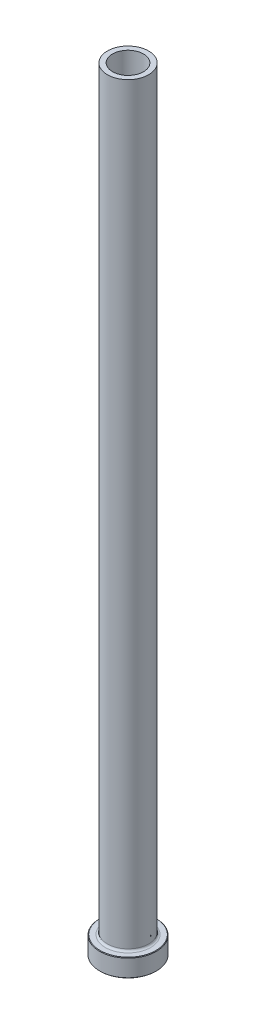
ISO-10303-21;
HEADER;
FILE_DESCRIPTION(('STEP AP214'),'2;1');
FILE_NAME('part.step','',(''),(''),'','','');
FILE_SCHEMA(('AUTOMOTIVE_DESIGN { 1 0 10303 214 1 1 1 1 }'));
ENDSEC;
DATA;
#1=APPLICATION_CONTEXT('core data for automotive mechanical design processes');
#2=APPLICATION_PROTOCOL_DEFINITION('international standard','automotive_design',2000,#1);
#3=PRODUCT_CONTEXT('',#1,'mechanical');
#4=PRODUCT('Part','Part','',(#3));
#5=PRODUCT_RELATED_PRODUCT_CATEGORY('part','',(#4));
#6=PRODUCT_DEFINITION_FORMATION('','',#4);
#7=PRODUCT_DEFINITION_CONTEXT('part definition',#1,'design');
#8=PRODUCT_DEFINITION('design','',#6,#7);
#9=PRODUCT_DEFINITION_SHAPE('','',#8);
#10=(LENGTH_UNIT() NAMED_UNIT(*) SI_UNIT(.MILLI.,.METRE.));
#11=(NAMED_UNIT(*) PLANE_ANGLE_UNIT() SI_UNIT($,.RADIAN.));
#12=(NAMED_UNIT(*) SI_UNIT($,.STERADIAN.) SOLID_ANGLE_UNIT());
#13=UNCERTAINTY_MEASURE_WITH_UNIT(LENGTH_MEASURE(1.E-05),#10,'distance_accuracy_value','');
#14=(GEOMETRIC_REPRESENTATION_CONTEXT(3) GLOBAL_UNCERTAINTY_ASSIGNED_CONTEXT((#13)) GLOBAL_UNIT_ASSIGNED_CONTEXT((#10,
#11,#12)) REPRESENTATION_CONTEXT('',''));
#15=CARTESIAN_POINT('',(0.,0.,0.));
#16=DIRECTION('',(0.,0.,1.));
#17=DIRECTION('',(1.,0.,0.));
#18=AXIS2_PLACEMENT_3D('',#15,#16,#17);
#19=CARTESIAN_POINT('',(0.,92.1876809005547,0.));
#20=DIRECTION('',(0.,1.,0.));
#21=DIRECTION('',(0.,0.,1.));
#22=AXIS2_PLACEMENT_3D('',#19,#20,#21);
#23=CYLINDRICAL_SURFACE('',#22,6.00000000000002);
#24=CARTESIAN_POINT('',(0.,300.,0.));
#25=DIRECTION('',(0.,1.,0.));
#26=DIRECTION('',(0.,0.,1.));
#27=AXIS2_PLACEMENT_3D('',#24,#25,#26);
#28=CIRCLE('',#27,6.00000000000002);
#29=CARTESIAN_POINT('',(0.,300.,6.00000000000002));
#30=VERTEX_POINT('',#29);
#31=EDGE_CURVE('E62',#30,#30,#28,.T.);
#32=ORIENTED_EDGE('',*,*,#31,.T.);
#33=EDGE_LOOP('',(#32));
#34=FACE_BOUND('',#33,.T.);
#35=CARTESIAN_POINT('',(0.,245.,0.));
#36=DIRECTION('',(0.,1.,0.));
#37=DIRECTION('',(0.,0.,1.));
#38=AXIS2_PLACEMENT_3D('',#35,#36,#37);
#39=CIRCLE('',#38,6.00000000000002);
#40=CARTESIAN_POINT('',(0.,245.,6.00000000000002));
#41=VERTEX_POINT('',#40);
#42=EDGE_CURVE('E71',#41,#41,#39,.T.);
#43=ORIENTED_EDGE('',*,*,#42,.F.);
#44=EDGE_LOOP('',(#43));
#45=FACE_BOUND('',#44,.T.);
#46=ADVANCED_FACE('F30',(#34,#45),#23,.F.);
#47=CARTESIAN_POINT('',(-6.00000000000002,300.,0.));
#48=DIRECTION('',(0.,1.,0.));
#49=DIRECTION('',(0.,0.,1.));
#50=AXIS2_PLACEMENT_3D('',#47,#48,#49);
#51=PLANE('',#50);
#52=CARTESIAN_POINT('',(0.,300.,0.));
#53=DIRECTION('',(0.,1.,0.));
#54=DIRECTION('',(0.,0.,1.));
#55=AXIS2_PLACEMENT_3D('',#52,#53,#54);
#56=CIRCLE('',#55,8.00000000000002);
#57=CARTESIAN_POINT('',(0.,300.,8.00000000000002));
#58=VERTEX_POINT('',#57);
#59=EDGE_CURVE('E65',#58,#58,#56,.T.);
#60=ORIENTED_EDGE('',*,*,#59,.T.);
#61=EDGE_LOOP('',(#60));
#62=FACE_BOUND('',#61,.T.);
#63=ORIENTED_EDGE('',*,*,#31,.F.);
#64=EDGE_LOOP('',(#63));
#65=FACE_BOUND('',#64,.T.);
#66=ADVANCED_FACE('F79',(#62,#65),#51,.T.);
#67=CARTESIAN_POINT('',(0.,92.1876809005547,0.));
#68=DIRECTION('',(0.,1.,0.));
#69=DIRECTION('',(0.,0.,1.));
#70=AXIS2_PLACEMENT_3D('',#67,#68,#69);
#71=CYLINDRICAL_SURFACE('',#70,8.00000000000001);
#72=CARTESIAN_POINT('',(0.,7.8,0.));
#73=DIRECTION('',(0.,1.,0.));
#74=DIRECTION('',(0.,0.,1.));
#75=AXIS2_PLACEMENT_3D('',#72,#73,#74);
#76=CIRCLE('',#75,8.00000000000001);
#77=CARTESIAN_POINT('',(0.,7.8,8.00000000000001));
#78=VERTEX_POINT('',#77);
#79=EDGE_CURVE('E59',#78,#78,#76,.T.);
#80=ORIENTED_EDGE('',*,*,#79,.T.);
#81=EDGE_LOOP('',(#80));
#82=FACE_BOUND('',#81,.T.);
#83=ORIENTED_EDGE('',*,*,#59,.F.);
#84=EDGE_LOOP('',(#83));
#85=FACE_BOUND('',#84,.T.);
#86=ADVANCED_FACE('F85',(#82,#85),#71,.T.);
#87=CARTESIAN_POINT('',(-7.99999999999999,7.,0.));
#88=DIRECTION('',(0.,1.,0.));
#89=DIRECTION('',(0.,0.,1.));
#90=AXIS2_PLACEMENT_3D('',#87,#88,#89);
#91=PLANE('',#90);
#92=CARTESIAN_POINT('',(0.,7.,0.));
#93=DIRECTION('',(0.,1.,0.));
#94=DIRECTION('',(0.,0.,1.));
#95=AXIS2_PLACEMENT_3D('',#92,#93,#94);
#96=CIRCLE('',#95,10.8);
#97=CARTESIAN_POINT('',(0.,7.,-10.8));
#98=VERTEX_POINT('',#97);
#99=EDGE_CURVE('E53',#98,#98,#96,.T.);
#100=ORIENTED_EDGE('',*,*,#99,.T.);
#101=EDGE_LOOP('',(#100));
#102=FACE_BOUND('',#101,.T.);
#103=CARTESIAN_POINT('',(0.,7.,0.));
#104=DIRECTION('',(0.,1.,0.));
#105=DIRECTION('',(0.,0.,1.));
#106=AXIS2_PLACEMENT_3D('',#103,#104,#105);
#107=CIRCLE('',#106,8.80000000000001);
#108=CARTESIAN_POINT('',(0.,7.,8.80000000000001));
#109=VERTEX_POINT('',#108);
#110=EDGE_CURVE('E56',#109,#109,#107,.F.);
#111=ORIENTED_EDGE('',*,*,#110,.T.);
#112=EDGE_LOOP('',(#111));
#113=FACE_BOUND('',#112,.T.);
#114=ADVANCED_FACE('F111',(#102,#113),#91,.T.);
#115=CARTESIAN_POINT('',(0.,92.1876809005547,0.));
#116=DIRECTION('',(0.,1.,0.));
#117=DIRECTION('',(0.,0.,1.));
#118=AXIS2_PLACEMENT_3D('',#115,#116,#117);
#119=CYLINDRICAL_SURFACE('',#118,11.);
#120=CARTESIAN_POINT('',(0.,6.80000000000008,0.));
#121=DIRECTION('',(0.,1.,0.));
#122=DIRECTION('',(0.,0.,1.));
#123=AXIS2_PLACEMENT_3D('',#120,#121,#122);
#124=CIRCLE('',#123,11.);
#125=CARTESIAN_POINT('',(0.,6.80000000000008,-11.));
#126=VERTEX_POINT('',#125);
#127=EDGE_CURVE('E45',#126,#126,#124,.F.);
#128=ORIENTED_EDGE('',*,*,#127,.T.);
#129=EDGE_LOOP('',(#128));
#130=FACE_BOUND('',#129,.T.);
#131=CARTESIAN_POINT('',(0.,0.200000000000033,0.));
#132=DIRECTION('',(0.,-1.,0.));
#133=DIRECTION('',(0.,0.,-1.));
#134=AXIS2_PLACEMENT_3D('',#131,#132,#133);
#135=CIRCLE('',#134,11.);
#136=CARTESIAN_POINT('',(0.,0.200000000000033,-11.));
#137=VERTEX_POINT('',#136);
#138=EDGE_CURVE('E50',#137,#137,#135,.F.);
#139=ORIENTED_EDGE('',*,*,#138,.T.);
#140=EDGE_LOOP('',(#139));
#141=FACE_BOUND('',#140,.T.);
#142=ADVANCED_FACE('F108',(#130,#141),#119,.T.);
#143=CARTESIAN_POINT('',(-11.,0.,0.));
#144=DIRECTION('',(0.,-1.,0.));
#145=DIRECTION('',(0.,0.,-1.));
#146=AXIS2_PLACEMENT_3D('',#143,#144,#145);
#147=PLANE('',#146);
#148=CARTESIAN_POINT('',(0.,0.,0.));
#149=DIRECTION('',(0.,-1.,0.));
#150=DIRECTION('',(0.,0.,-1.));
#151=AXIS2_PLACEMENT_3D('',#148,#149,#150);
#152=CIRCLE('',#151,6.74999999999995);
#153=CARTESIAN_POINT('',(0.,0.,-6.74999999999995));
#154=VERTEX_POINT('',#153);
#155=EDGE_CURVE('E37',#154,#154,#152,.F.);
#156=ORIENTED_EDGE('',*,*,#155,.T.);
#157=EDGE_LOOP('',(#156));
#158=FACE_BOUND('',#157,.T.);
#159=CARTESIAN_POINT('',(0.,0.,0.));
#160=DIRECTION('',(0.,-1.,0.));
#161=DIRECTION('',(0.,0.,-1.));
#162=AXIS2_PLACEMENT_3D('',#159,#160,#161);
#163=CIRCLE('',#162,10.8);
#164=CARTESIAN_POINT('',(0.,0.,-10.8));
#165=VERTEX_POINT('',#164);
#166=EDGE_CURVE('E41',#165,#165,#163,.T.);
#167=ORIENTED_EDGE('',*,*,#166,.T.);
#168=EDGE_LOOP('',(#167));
#169=FACE_BOUND('',#168,.T.);
#170=ADVANCED_FACE('F110',(#158,#169),#147,.T.);
#171=CARTESIAN_POINT('',(0.,92.1876809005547,0.));
#172=DIRECTION('',(0.,1.,0.));
#173=DIRECTION('',(0.,0.,1.));
#174=AXIS2_PLACEMENT_3D('',#171,#172,#173);
#175=CYLINDRICAL_SURFACE('',#174,6.25);
#176=CARTESIAN_POINT('',(0.,0.499999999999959,0.));
#177=DIRECTION('',(0.,-1.,0.));
#178=DIRECTION('',(0.,0.,-1.));
#179=AXIS2_PLACEMENT_3D('',#176,#177,#178);
#180=CIRCLE('',#179,6.25);
#181=CARTESIAN_POINT('',(0.,0.499999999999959,-6.25));
#182=VERTEX_POINT('',#181);
#183=EDGE_CURVE('E10',#182,#182,#180,.T.);
#184=ORIENTED_EDGE('',*,*,#183,.T.);
#185=EDGE_LOOP('',(#184));
#186=FACE_BOUND('',#185,.T.);
#187=CARTESIAN_POINT('',(0.,233.,0.));
#188=DIRECTION('',(0.,1.,0.));
#189=DIRECTION('',(0.,0.,1.));
#190=AXIS2_PLACEMENT_3D('',#187,#188,#189);
#191=CIRCLE('',#190,6.25000000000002);
#192=CARTESIAN_POINT('',(0.,233.,6.25000000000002));
#193=VERTEX_POINT('',#192);
#194=EDGE_CURVE('E68',#193,#193,#191,.T.);
#195=ORIENTED_EDGE('',*,*,#194,.T.);
#196=EDGE_LOOP('',(#195));
#197=FACE_BOUND('',#196,.T.);
#198=ADVANCED_FACE('F118',(#186,#197),#175,.F.);
#199=CARTESIAN_POINT('',(0.,233.,0.));
#200=DIRECTION('',(0.,-1.,0.));
#201=DIRECTION('',(0.,0.,-1.));
#202=AXIS2_PLACEMENT_3D('',#199,#200,#201);
#203=CONICAL_SURFACE('',#202,6.25000000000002,0.0208303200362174);
#204=ORIENTED_EDGE('',*,*,#42,.T.);
#205=EDGE_LOOP('',(#204));
#206=FACE_BOUND('',#205,.T.);
#207=ORIENTED_EDGE('',*,*,#194,.F.);
#208=EDGE_LOOP('',(#207));
#209=FACE_BOUND('',#208,.T.);
#210=ADVANCED_FACE('F75',(#206,#209),#203,.F.);
#211=CARTESIAN_POINT('',(0.,7.8,0.));
#212=DIRECTION('',(0.,1.,0.));
#213=DIRECTION('',(0.,0.,1.));
#214=AXIS2_PLACEMENT_3D('',#211,#212,#213);
#215=TOROIDAL_SURFACE('',#214,8.80000000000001,0.8);
#216=ORIENTED_EDGE('',*,*,#110,.F.);
#217=EDGE_LOOP('',(#216));
#218=FACE_BOUND('',#217,.T.);
#219=ORIENTED_EDGE('',*,*,#79,.F.);
#220=EDGE_LOOP('',(#219));
#221=FACE_BOUND('',#220,.T.);
#222=ADVANCED_FACE('F90',(#218,#221),#215,.F.);
#223=CARTESIAN_POINT('',(0.,7.00000000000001,0.));
#224=DIRECTION('',(0.,-1.,0.));
#225=DIRECTION('',(0.,0.,-1.));
#226=AXIS2_PLACEMENT_3D('',#223,#224,#225);
#227=CONICAL_SURFACE('',#226,10.8,0.785398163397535);
#228=CARTESIAN_POINT('',(0.,6.80000000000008,-11.));
#229=CARTESIAN_POINT('',(0.,6.80208333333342,-10.9979166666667));
#230=CARTESIAN_POINT('',(0.,6.80416666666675,-10.9958333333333));
#231=CARTESIAN_POINT('',(0.,6.80833333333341,-10.9916666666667));
#232=CARTESIAN_POINT('',(0.,6.81041666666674,-10.9895833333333));
#233=CARTESIAN_POINT('',(0.,6.81458333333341,-10.9854166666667));
#234=CARTESIAN_POINT('',(0.,6.81666666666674,-10.9833333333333));
#235=CARTESIAN_POINT('',(0.,6.82083333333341,-10.9791666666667));
#236=CARTESIAN_POINT('',(0.,6.82291666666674,-10.9770833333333));
#237=CARTESIAN_POINT('',(0.,6.82708333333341,-10.9729166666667));
#238=CARTESIAN_POINT('',(0.,6.82916666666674,-10.9708333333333));
#239=CARTESIAN_POINT('',(0.,6.8333333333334,-10.9666666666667));
#240=CARTESIAN_POINT('',(0.,6.83541666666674,-10.9645833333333));
#241=CARTESIAN_POINT('',(0.,6.8395833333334,-10.9604166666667));
#242=CARTESIAN_POINT('',(0.,6.84166666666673,-10.9583333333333));
#243=CARTESIAN_POINT('',(0.,6.8458333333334,-10.9541666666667));
#244=CARTESIAN_POINT('',(0.,6.84791666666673,-10.9520833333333));
#245=CARTESIAN_POINT('',(0.,6.8520833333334,-10.9479166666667));
#246=CARTESIAN_POINT('',(0.,6.85416666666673,-10.9458333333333));
#247=CARTESIAN_POINT('',(0.,6.85833333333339,-10.9416666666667));
#248=CARTESIAN_POINT('',(0.,6.86041666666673,-10.9395833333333));
#249=CARTESIAN_POINT('',(0.,6.86458333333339,-10.9354166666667));
#250=CARTESIAN_POINT('',(0.,6.86666666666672,-10.9333333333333));
#251=CARTESIAN_POINT('',(0.,6.87083333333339,-10.9291666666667));
#252=CARTESIAN_POINT('',(0.,6.87291666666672,-10.9270833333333));
#253=CARTESIAN_POINT('',(0.,6.87708333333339,-10.9229166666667));
#254=CARTESIAN_POINT('',(0.,6.87916666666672,-10.9208333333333));
#255=CARTESIAN_POINT('',(0.,6.88333333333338,-10.9166666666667));
#256=CARTESIAN_POINT('',(0.,6.88541666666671,-10.9145833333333));
#257=CARTESIAN_POINT('',(0.,6.88958333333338,-10.9104166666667));
#258=CARTESIAN_POINT('',(0.,6.89166666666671,-10.9083333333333));
#259=CARTESIAN_POINT('',(0.,6.89583333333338,-10.9041666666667));
#260=CARTESIAN_POINT('',(0.,6.89791666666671,-10.9020833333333));
#261=CARTESIAN_POINT('',(0.,6.90208333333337,-10.8979166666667));
#262=CARTESIAN_POINT('',(0.,6.90416666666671,-10.8958333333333));
#263=CARTESIAN_POINT('',(0.,6.90833333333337,-10.8916666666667));
#264=CARTESIAN_POINT('',(0.,6.9104166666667,-10.8895833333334));
#265=CARTESIAN_POINT('',(0.,6.91458333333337,-10.8854166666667));
#266=CARTESIAN_POINT('',(0.,6.9166666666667,-10.8833333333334));
#267=CARTESIAN_POINT('',(0.,6.92083333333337,-10.8791666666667));
#268=CARTESIAN_POINT('',(0.,6.9229166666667,-10.8770833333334));
#269=CARTESIAN_POINT('',(0.,6.92708333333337,-10.8729166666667));
#270=CARTESIAN_POINT('',(0.,6.9291666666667,-10.8708333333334));
#271=CARTESIAN_POINT('',(0.,6.93333333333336,-10.8666666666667));
#272=CARTESIAN_POINT('',(0.,6.93541666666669,-10.8645833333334));
#273=CARTESIAN_POINT('',(0.,6.93958333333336,-10.8604166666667));
#274=CARTESIAN_POINT('',(0.,6.94166666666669,-10.8583333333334));
#275=CARTESIAN_POINT('',(0.,6.94583333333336,-10.8541666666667));
#276=CARTESIAN_POINT('',(0.,6.94791666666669,-10.8520833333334));
#277=CARTESIAN_POINT('',(0.,6.95208333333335,-10.8479166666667));
#278=CARTESIAN_POINT('',(0.,6.95416666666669,-10.8458333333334));
#279=CARTESIAN_POINT('',(0.,6.95833333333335,-10.8416666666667));
#280=CARTESIAN_POINT('',(0.,6.96041666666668,-10.8395833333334));
#281=CARTESIAN_POINT('',(0.,6.96458333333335,-10.8354166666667));
#282=CARTESIAN_POINT('',(0.,6.96666666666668,-10.8333333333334));
#283=CARTESIAN_POINT('',(0.,6.97083333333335,-10.8291666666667));
#284=CARTESIAN_POINT('',(0.,6.97291666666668,-10.8270833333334));
#285=CARTESIAN_POINT('',(0.,6.97708333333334,-10.8229166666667));
#286=CARTESIAN_POINT('',(0.,6.97916666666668,-10.8208333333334));
#287=CARTESIAN_POINT('',(0.,6.98333333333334,-10.8166666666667));
#288=CARTESIAN_POINT('',(0.,6.98541666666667,-10.8145833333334));
#289=CARTESIAN_POINT('',(0.,6.98958333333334,-10.8104166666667));
#290=CARTESIAN_POINT('',(0.,6.99166666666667,-10.8083333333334));
#291=CARTESIAN_POINT('',(0.,6.99583333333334,-10.8041666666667));
#292=CARTESIAN_POINT('',(0.,6.99791666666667,-10.8020833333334));
#293=CARTESIAN_POINT('',(0.,7.,-10.8));
#294=B_SPLINE_CURVE_WITH_KNOTS('',3,(#228,#229,#230,#231,#232,#233,#234,#235,#236,#237,#238,
#239,#240,#241,#242,#243,#244,#245,#246,#247,#248,#249,#250,#251,#252,#253,#254,#255,#256,#257,
#258,#259,#260,#261,#262,#263,#264,#265,#266,#267,#268,#269,#270,#271,#272,#273,#274,#275,#276,
#277,#278,#279,#280,#281,#282,#283,#284,#285,#286,#287,#288,#289,#290,#291,#292,#293),
.UNSPECIFIED.,.F.,.F.,(4,2,2,2,2,2,2,2,2,2,2,2,2,2,2,2,2,2,2,2,2,2,2,2,2,2,2,2,2,2,2,2,4),(0.,
0.00883883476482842,0.0176776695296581,0.0265165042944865,0.0353553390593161,0.0441941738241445,
0.0530330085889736,0.061871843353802,0.0707106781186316,0.0795495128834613,0.0883883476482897,
0.0972271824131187,0.106066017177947,0.114904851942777,0.123743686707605,0.132582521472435,
0.141421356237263,0.150260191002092,0.159099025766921,0.16793786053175,0.176776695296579,
0.185615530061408,0.194454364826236,0.203293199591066,0.212132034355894,0.220970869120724,
0.229809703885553,0.238648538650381,0.247487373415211,0.256326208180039,0.265165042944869,
0.274003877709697,0.282842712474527),.UNSPECIFIED.);
#295=EDGE_CURVE('BSEAM93',#126,#98,#294,.T.);
#296=ORIENTED_EDGE('',*,*,#127,.F.);
#297=ORIENTED_EDGE('',*,*,#99,.F.);
#298=ORIENTED_EDGE('',*,*,#295,.T.);
#299=ORIENTED_EDGE('',*,*,#295,.F.);
#300=EDGE_LOOP('',(#296,#298,#297,#299));
#301=FACE_BOUND('',#300,.T.);
#302=ADVANCED_FACE('F93',(#301),#227,.T.);
#303=CARTESIAN_POINT('',(0.,0.200000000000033,0.));
#304=DIRECTION('',(0.,1.,0.));
#305=DIRECTION('',(0.,0.,1.));
#306=AXIS2_PLACEMENT_3D('',#303,#304,#305);
#307=CONICAL_SURFACE('',#306,11.,0.785398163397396);
#308=ORIENTED_EDGE('',*,*,#166,.F.);
#309=EDGE_LOOP('',(#308));
#310=FACE_BOUND('',#309,.T.);
#311=ORIENTED_EDGE('',*,*,#138,.F.);
#312=EDGE_LOOP('',(#311));
#313=FACE_BOUND('',#312,.T.);
#314=ADVANCED_FACE('F96',(#310,#313),#307,.T.);
#315=CARTESIAN_POINT('',(0.,0.,0.));
#316=DIRECTION('',(0.,-1.,0.));
#317=DIRECTION('',(0.,0.,-1.));
#318=AXIS2_PLACEMENT_3D('',#315,#316,#317);
#319=CONICAL_SURFACE('',#318,6.74999999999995,0.785398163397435);
#320=ORIENTED_EDGE('',*,*,#183,.F.);
#321=EDGE_LOOP('',(#320));
#322=FACE_BOUND('',#321,.T.);
#323=ORIENTED_EDGE('',*,*,#155,.F.);
#324=EDGE_LOOP('',(#323));
#325=FACE_BOUND('',#324,.T.);
#326=ADVANCED_FACE('F32',(#322,#325),#319,.F.);
#327=CLOSED_SHELL('',(#46,#66,#86,#114,#142,#170,#198,#210,#222,#302,#314,#326));
#328=MANIFOLD_SOLID_BREP('B2',#327);
#329=ADVANCED_BREP_SHAPE_REPRESENTATION('',(#18,#328),#14);
#330=SHAPE_DEFINITION_REPRESENTATION(#9,#329);
ENDSEC;
END-ISO-10303-21;
